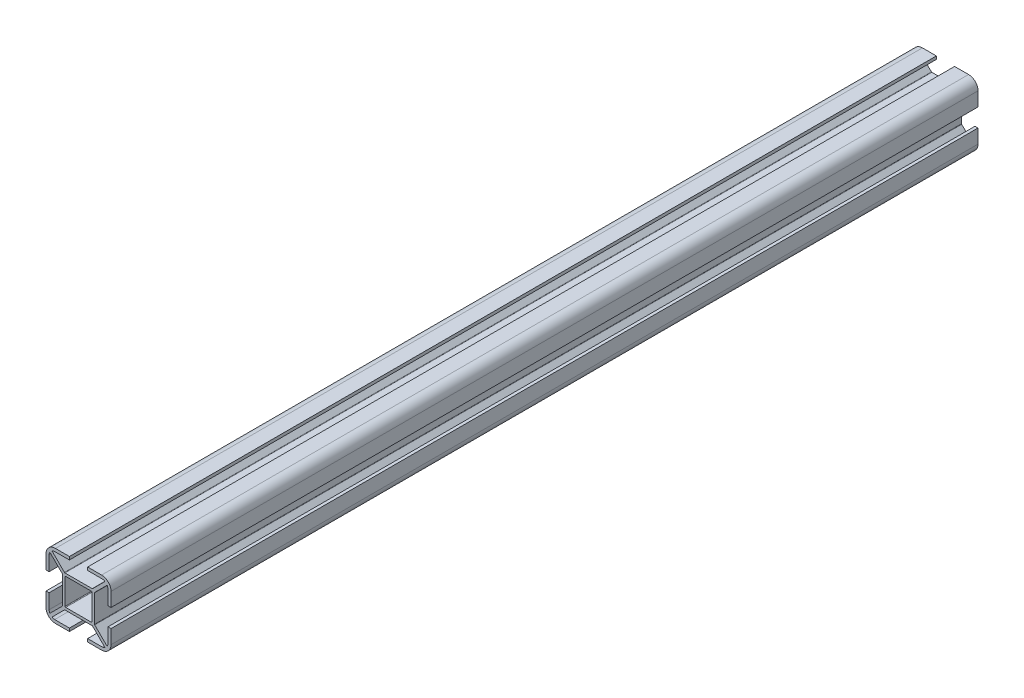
from build123d import *

# Parameters (mm, degrees)
EXTRUDE_1_DEPTH = 400


with BuildPart() as part:
    # Sketch 1 → Extrude 1 (new body)
    with BuildSketch(Plane.XY):
        with BuildLine():
            ThreePointArc((-10.65, 15), (-13.725914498, 13.725914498), (-15, 10.65))
            Line((-15, 10.65), (-15, 4.2))
            Line((-15, 4.2), (-13.6, 4.2))
            Line((-13.6, 4.2), (-13.6, 11))
            ThreePointArc((-13.6, 11), (-13.457683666, 11.620521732), (-13.186420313, 12.196470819))
            Line((-13.186420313, 12.196470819), (-7.487867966, 6.497918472))
            ThreePointArc((-7.487867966, 6.497918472), (-7.42283614, 6.400591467), (-7.4, 6.285786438))
            Line((-7.4, 6.285786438), (-7.4, 0))
            Line((-7.4, 0), (-7.4, -6.285786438))
            ThreePointArc((-7.4, -6.285786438), (-7.42283614, -6.400591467), (-7.487867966, -6.497918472))
            Line((-7.487867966, -6.497918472), (-13.186420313, -12.196470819))
            ThreePointArc((-13.186420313, -12.196470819), (-13.457683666, -11.620521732), (-13.6, -11))
            Line((-13.6, -11), (-13.6, -4.2))
            Line((-13.6, -4.2), (-15, -4.2))
            Line((-15, -4.2), (-15, -10.65))
            ThreePointArc((-15, -10.65), (-13.725914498, -13.725914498), (-10.65, -15))
            Line((-10.65, -15), (-4.2, -15))
            Line((-4.2, -15), (-4.2, -13.6))
            Line((-4.2, -13.6), (-11, -13.6))
            ThreePointArc((-11, -13.6), (-11.620521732, -13.457683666), (-12.196470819, -13.186420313))
            Line((-12.196470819, -13.186420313), (-6.497918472, -7.487867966))
            ThreePointArc((-6.497918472, -7.487867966), (-6.400591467, -7.42283614), (-6.285786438, -7.4))
            Line((-6.285786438, -7.4), (6.285786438, -7.4))
            ThreePointArc((6.285786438, -7.4), (6.400591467, -7.42283614), (6.497918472, -7.487867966))
            Line((6.497918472, -7.487867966), (12.196470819, -13.186420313))
            ThreePointArc((12.196470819, -13.186420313), (11.620521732, -13.457683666), (11, -13.6))
            Line((11, -13.6), (4.2, -13.6))
            Line((4.2, -13.6), (4.2, -15))
            Line((4.2, -15), (10.65, -15))
            ThreePointArc((10.65, -15), (13.725914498, -13.725914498), (15, -10.65))
            Line((15, -10.65), (15, -4.2))
            Line((15, -4.2), (13.6, -4.2))
            Line((13.6, -4.2), (13.6, -11))
            ThreePointArc((13.6, -11), (13.457683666, -11.620521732), (13.186420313, -12.196470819))
            Line((13.186420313, -12.196470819), (7.487867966, -6.497918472))
            ThreePointArc((7.487867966, -6.497918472), (7.42283614, -6.400591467), (7.4, -6.285786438))
            Line((7.4, -6.285786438), (7.4, 0))
            Line((7.4, 0), (7.4, 6.285786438))
            ThreePointArc((7.4, 6.285786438), (7.42283614, 6.400591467), (7.487867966, 6.497918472))
            Line((7.487867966, 6.497918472), (13.186420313, 12.196470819))
            ThreePointArc((13.186420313, 12.196470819), (13.457683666, 11.620521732), (13.6, 11))
            Line((13.6, 11), (13.6, 4.2))
            Line((13.6, 4.2), (15, 4.2))
            Line((15, 4.2), (15, 10.65))
            ThreePointArc((15, 10.65), (13.725914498, 13.725914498), (10.65, 15))
            Line((10.65, 15), (4.2, 15))
            Line((4.2, 15), (4.2, 13.6))
            Line((4.2, 13.6), (11, 13.6))
            ThreePointArc((11, 13.6), (11.620521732, 13.457683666), (12.196470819, 13.186420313))
            Line((12.196470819, 13.186420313), (6.497918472, 7.487867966))
            ThreePointArc((6.497918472, 7.487867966), (6.400591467, 7.42283614), (6.285786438, 7.4))
            Line((6.285786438, 7.4), (0, 7.4))
            Line((0, 7.4), (-6.285786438, 7.4))
            ThreePointArc((-6.285786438, 7.4), (-6.400591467, 7.42283614), (-6.497918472, 7.487867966))
            Line((-6.497918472, 7.487867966), (-12.196470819, 13.186420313))
            ThreePointArc((-12.196470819, 13.186420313), (-11.620521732, 13.457683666), (-11, 13.6))
            Line((-11, 13.6), (-4.2, 13.6))
            Line((-4.2, 13.6), (-4.2, 15))
            Line((-4.2, 15), (-10.65, 15))
        make_face()
        with BuildLine():
            Line((0.01702519, 6.2), (5.9, 6.2))
            ThreePointArc((5.9, 6.2), (6.112132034, 6.112132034), (6.2, 5.9))
            Line((6.2, 5.9), (6.2, -0.01702519))
            Line((6.2, -0.01702519), (6.2, -5.9))
            ThreePointArc((6.2, -5.9), (6.112132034, -6.112132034), (5.9, -6.2))
            Line((5.9, -6.2), (0.01702519, -6.2))
            Line((0.01702519, -6.2), (-0.01702519, -6.2))
            Line((-0.01702519, -6.2), (-5.9, -6.2))
            ThreePointArc((-5.9, -6.2), (-6.112132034, -6.112132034), (-6.2, -5.9))
            Line((-6.2, -5.9), (-6.2, -0.01702519))
            Line((-6.2, -0.01702519), (-6.2, 0))
            Line((-6.2, 0), (-6.2, 5.9))
            ThreePointArc((-6.2, 5.9), (-6.112132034, 6.112132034), (-5.9, 6.2))
            Line((-5.9, 6.2), (0, 6.2))
            Line((0, 6.2), (0.01702519, 6.2))
        make_face(mode=Mode.SUBTRACT)
    extrude(amount=EXTRUDE_1_DEPTH)


solid = part.part
